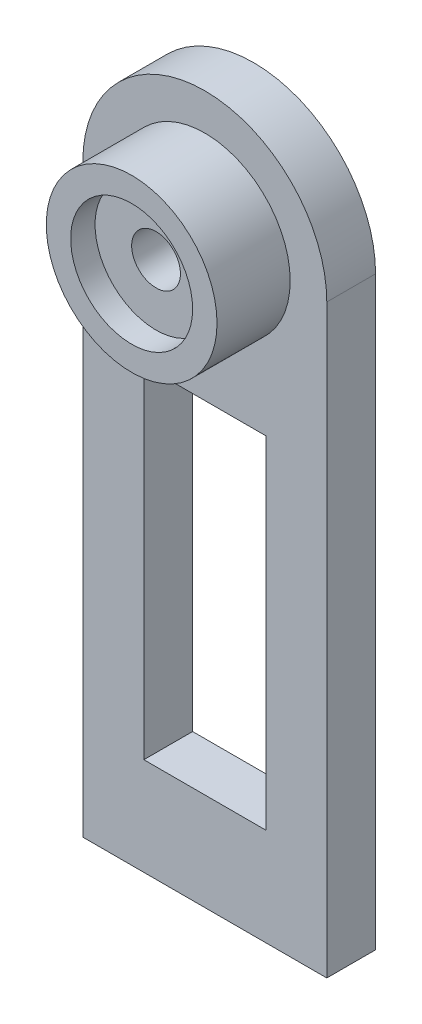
ISO-10303-21;
HEADER;
FILE_DESCRIPTION(('STEP AP214'),'2;1');
FILE_NAME('part.step','',(''),(''),'','','');
FILE_SCHEMA(('AUTOMOTIVE_DESIGN { 1 0 10303 214 1 1 1 1 }'));
ENDSEC;
DATA;
#1=APPLICATION_CONTEXT('core data for automotive mechanical design processes');
#2=APPLICATION_PROTOCOL_DEFINITION('international standard','automotive_design',2000,#1);
#3=PRODUCT_CONTEXT('',#1,'mechanical');
#4=PRODUCT('Part','Part','',(#3));
#5=PRODUCT_RELATED_PRODUCT_CATEGORY('part','',(#4));
#6=PRODUCT_DEFINITION_FORMATION('','',#4);
#7=PRODUCT_DEFINITION_CONTEXT('part definition',#1,'design');
#8=PRODUCT_DEFINITION('design','',#6,#7);
#9=PRODUCT_DEFINITION_SHAPE('','',#8);
#10=(LENGTH_UNIT() NAMED_UNIT(*) SI_UNIT(.MILLI.,.METRE.));
#11=(NAMED_UNIT(*) PLANE_ANGLE_UNIT() SI_UNIT($,.RADIAN.));
#12=(NAMED_UNIT(*) SI_UNIT($,.STERADIAN.) SOLID_ANGLE_UNIT());
#13=UNCERTAINTY_MEASURE_WITH_UNIT(LENGTH_MEASURE(1.E-05),#10,'distance_accuracy_value','');
#14=(GEOMETRIC_REPRESENTATION_CONTEXT(3) GLOBAL_UNCERTAINTY_ASSIGNED_CONTEXT((#13)) GLOBAL_UNIT_ASSIGNED_CONTEXT((#10,
#11,#12)) REPRESENTATION_CONTEXT('',''));
#15=CARTESIAN_POINT('',(0.,0.,0.));
#16=DIRECTION('',(0.,0.,1.));
#17=DIRECTION('',(1.,0.,0.));
#18=AXIS2_PLACEMENT_3D('',#15,#16,#17);
#19=CARTESIAN_POINT('',(50.,240.,0.));
#20=DIRECTION('',(0.,0.,1.));
#21=DIRECTION('',(1.,0.,0.));
#22=AXIS2_PLACEMENT_3D('',#19,#20,#21);
#23=PLANE('',#22);
#24=DIRECTION('',(0.,-1.,0.));
#25=VECTOR('',#24,1.);
#26=CARTESIAN_POINT('',(25.,40.,0.));
#27=LINE('',#26,#25);
#28=CARTESIAN_POINT('',(25.,180.,0.));
#29=VERTEX_POINT('',#28);
#30=CARTESIAN_POINT('',(25.,40.,0.));
#31=VERTEX_POINT('',#30);
#32=EDGE_CURVE('E52',#29,#31,#27,.T.);
#33=ORIENTED_EDGE('',*,*,#32,.F.);
#34=DIRECTION('',(-1.,0.,0.));
#35=VECTOR('',#34,1.);
#36=CARTESIAN_POINT('',(25.,180.,0.));
#37=LINE('',#36,#35);
#38=CARTESIAN_POINT('',(75.,180.,0.));
#39=VERTEX_POINT('',#38);
#40=EDGE_CURVE('E118',#39,#29,#37,.T.);
#41=ORIENTED_EDGE('',*,*,#40,.F.);
#42=DIRECTION('',(0.,1.,0.));
#43=VECTOR('',#42,1.);
#44=CARTESIAN_POINT('',(75.,40.,0.));
#45=LINE('',#44,#43);
#46=CARTESIAN_POINT('',(75.,40.,0.));
#47=VERTEX_POINT('',#46);
#48=EDGE_CURVE('E103',#47,#39,#45,.T.);
#49=ORIENTED_EDGE('',*,*,#48,.F.);
#50=DIRECTION('',(1.,0.,0.));
#51=VECTOR('',#50,1.);
#52=CARTESIAN_POINT('',(25.,40.,0.));
#53=LINE('',#52,#51);
#54=EDGE_CURVE('E112',#31,#47,#53,.T.);
#55=ORIENTED_EDGE('',*,*,#54,.F.);
#56=EDGE_LOOP('',(#33,#41,#49,#55));
#57=FACE_BOUND('',#56,.T.);
#58=DIRECTION('',(0.,-1.,0.));
#59=VECTOR('',#58,1.);
#60=CARTESIAN_POINT('',(0.,240.,0.));
#61=LINE('',#60,#59);
#62=CARTESIAN_POINT('',(0.,240.,0.));
#63=VERTEX_POINT('',#62);
#64=CARTESIAN_POINT('',(0.,0.,0.));
#65=VERTEX_POINT('',#64);
#66=EDGE_CURVE('E154',#63,#65,#61,.T.);
#67=ORIENTED_EDGE('',*,*,#66,.T.);
#68=DIRECTION('',(1.,0.,0.));
#69=VECTOR('',#68,1.);
#70=CARTESIAN_POINT('',(0.,0.,0.));
#71=LINE('',#70,#69);
#72=CARTESIAN_POINT('',(100.,0.,0.));
#73=VERTEX_POINT('',#72);
#74=EDGE_CURVE('E157',#65,#73,#71,.T.);
#75=ORIENTED_EDGE('',*,*,#74,.T.);
#76=DIRECTION('',(0.,1.,0.));
#77=VECTOR('',#76,1.);
#78=CARTESIAN_POINT('',(100.,0.,0.));
#79=LINE('',#78,#77);
#80=CARTESIAN_POINT('',(100.,240.,0.));
#81=VERTEX_POINT('',#80);
#82=EDGE_CURVE('E160',#73,#81,#79,.T.);
#83=ORIENTED_EDGE('',*,*,#82,.T.);
#84=CARTESIAN_POINT('',(50.,240.,0.));
#85=DIRECTION('',(0.,0.,1.));
#86=DIRECTION('',(1.,0.,0.));
#87=AXIS2_PLACEMENT_3D('',#84,#85,#86);
#88=CIRCLE('',#87,50.);
#89=EDGE_CURVE('E163',#81,#63,#88,.T.);
#90=ORIENTED_EDGE('',*,*,#89,.T.);
#91=EDGE_LOOP('',(#67,#75,#83,#90));
#92=FACE_BOUND('',#91,.T.);
#93=CARTESIAN_POINT('',(50.,240.,0.));
#94=DIRECTION('',(0.,0.,1.));
#95=DIRECTION('',(1.,0.,0.));
#96=AXIS2_PLACEMENT_3D('',#93,#94,#95);
#97=CIRCLE('',#96,35.);
#98=CARTESIAN_POINT('',(85.,240.,0.));
#99=VERTEX_POINT('',#98);
#100=EDGE_CURVE('E148',#99,#99,#97,.T.);
#101=ORIENTED_EDGE('',*,*,#100,.F.);
#102=EDGE_LOOP('',(#101));
#103=FACE_BOUND('',#102,.T.);
#104=ADVANCED_FACE('F35',(#57,#92,#103),#23,.T.);
#105=CARTESIAN_POINT('',(0.,240.,-20.));
#106=DIRECTION('',(-1.,0.,0.));
#107=DIRECTION('',(0.,0.,1.));
#108=AXIS2_PLACEMENT_3D('',#105,#106,#107);
#109=PLANE('',#108);
#110=ORIENTED_EDGE('',*,*,#66,.F.);
#111=DIRECTION('',(0.,0.,1.));
#112=VECTOR('',#111,1.);
#113=CARTESIAN_POINT('',(0.,240.,-20.));
#114=LINE('',#113,#112);
#115=CARTESIAN_POINT('',(0.,240.,-20.));
#116=VERTEX_POINT('',#115);
#117=EDGE_CURVE('E11',#116,#63,#114,.T.);
#118=ORIENTED_EDGE('',*,*,#117,.F.);
#119=DIRECTION('',(0.,-1.,0.));
#120=VECTOR('',#119,1.);
#121=CARTESIAN_POINT('',(0.,240.,-20.));
#122=LINE('',#121,#120);
#123=CARTESIAN_POINT('',(0.,0.,-20.));
#124=VERTEX_POINT('',#123);
#125=EDGE_CURVE('E166',#116,#124,#122,.T.);
#126=ORIENTED_EDGE('',*,*,#125,.T.);
#127=DIRECTION('',(0.,0.,1.));
#128=VECTOR('',#127,1.);
#129=CARTESIAN_POINT('',(0.,0.,-20.));
#130=LINE('',#129,#128);
#131=EDGE_CURVE('E39',#124,#65,#130,.T.);
#132=ORIENTED_EDGE('',*,*,#131,.T.);
#133=EDGE_LOOP('',(#110,#118,#126,#132));
#134=FACE_BOUND('',#133,.T.);
#135=ADVANCED_FACE('F37',(#134),#109,.T.);
#136=CARTESIAN_POINT('',(50.,240.,-20.));
#137=DIRECTION('',(0.,0.,1.));
#138=DIRECTION('',(1.,0.,0.));
#139=AXIS2_PLACEMENT_3D('',#136,#137,#138);
#140=CYLINDRICAL_SURFACE('',#139,50.);
#141=ORIENTED_EDGE('',*,*,#89,.F.);
#142=DIRECTION('',(0.,0.,1.));
#143=VECTOR('',#142,1.);
#144=CARTESIAN_POINT('',(100.,240.,-20.));
#145=LINE('',#144,#143);
#146=CARTESIAN_POINT('',(100.,240.,-20.));
#147=VERTEX_POINT('',#146);
#148=EDGE_CURVE('E44',#147,#81,#145,.T.);
#149=ORIENTED_EDGE('',*,*,#148,.F.);
#150=CARTESIAN_POINT('',(50.,240.,-20.));
#151=DIRECTION('',(0.,0.,1.));
#152=DIRECTION('',(1.,0.,0.));
#153=AXIS2_PLACEMENT_3D('',#150,#151,#152);
#154=CIRCLE('',#153,50.);
#155=EDGE_CURVE('E175',#147,#116,#154,.T.);
#156=ORIENTED_EDGE('',*,*,#155,.T.);
#157=ORIENTED_EDGE('',*,*,#117,.T.);
#158=EDGE_LOOP('',(#141,#149,#156,#157));
#159=FACE_BOUND('',#158,.T.);
#160=ADVANCED_FACE('F190',(#159),#140,.T.);
#161=CARTESIAN_POINT('',(100.,0.,-20.));
#162=DIRECTION('',(1.,0.,0.));
#163=DIRECTION('',(0.,0.,-1.));
#164=AXIS2_PLACEMENT_3D('',#161,#162,#163);
#165=PLANE('',#164);
#166=ORIENTED_EDGE('',*,*,#82,.F.);
#167=DIRECTION('',(0.,0.,1.));
#168=VECTOR('',#167,1.);
#169=CARTESIAN_POINT('',(100.,0.,-20.));
#170=LINE('',#169,#168);
#171=CARTESIAN_POINT('',(100.,0.,-20.));
#172=VERTEX_POINT('',#171);
#173=EDGE_CURVE('E178',#172,#73,#170,.T.);
#174=ORIENTED_EDGE('',*,*,#173,.F.);
#175=DIRECTION('',(0.,1.,0.));
#176=VECTOR('',#175,1.);
#177=CARTESIAN_POINT('',(100.,0.,-20.));
#178=LINE('',#177,#176);
#179=EDGE_CURVE('E172',#172,#147,#178,.T.);
#180=ORIENTED_EDGE('',*,*,#179,.T.);
#181=ORIENTED_EDGE('',*,*,#148,.T.);
#182=EDGE_LOOP('',(#166,#174,#180,#181));
#183=FACE_BOUND('',#182,.T.);
#184=ADVANCED_FACE('F196',(#183),#165,.T.);
#185=CARTESIAN_POINT('',(0.,0.,-20.));
#186=DIRECTION('',(0.,-1.,0.));
#187=DIRECTION('',(0.,0.,-1.));
#188=AXIS2_PLACEMENT_3D('',#185,#186,#187);
#189=PLANE('',#188);
#190=ORIENTED_EDGE('',*,*,#74,.F.);
#191=ORIENTED_EDGE('',*,*,#131,.F.);
#192=DIRECTION('',(1.,0.,0.));
#193=VECTOR('',#192,1.);
#194=CARTESIAN_POINT('',(0.,0.,-20.));
#195=LINE('',#194,#193);
#196=EDGE_CURVE('E169',#124,#172,#195,.T.);
#197=ORIENTED_EDGE('',*,*,#196,.T.);
#198=ORIENTED_EDGE('',*,*,#173,.T.);
#199=EDGE_LOOP('',(#190,#191,#197,#198));
#200=FACE_BOUND('',#199,.T.);
#201=ADVANCED_FACE('F186',(#200),#189,.T.);
#202=CARTESIAN_POINT('',(50.,240.,-20.));
#203=DIRECTION('',(0.,0.,1.));
#204=DIRECTION('',(1.,0.,0.));
#205=AXIS2_PLACEMENT_3D('',#202,#203,#204);
#206=PLANE('',#205);
#207=DIRECTION('',(-1.,0.,0.));
#208=VECTOR('',#207,1.);
#209=CARTESIAN_POINT('',(25.,180.,-20.));
#210=LINE('',#209,#208);
#211=CARTESIAN_POINT('',(75.,180.,-20.));
#212=VERTEX_POINT('',#211);
#213=CARTESIAN_POINT('',(25.,180.,-20.));
#214=VERTEX_POINT('',#213);
#215=EDGE_CURVE('E129',#212,#214,#210,.T.);
#216=ORIENTED_EDGE('',*,*,#215,.T.);
#217=DIRECTION('',(0.,-1.,0.));
#218=VECTOR('',#217,1.);
#219=CARTESIAN_POINT('',(25.,40.,-20.));
#220=LINE('',#219,#218);
#221=CARTESIAN_POINT('',(25.,40.,-20.));
#222=VERTEX_POINT('',#221);
#223=EDGE_CURVE('E120',#214,#222,#220,.T.);
#224=ORIENTED_EDGE('',*,*,#223,.T.);
#225=DIRECTION('',(1.,0.,0.));
#226=VECTOR('',#225,1.);
#227=CARTESIAN_POINT('',(25.,40.,-20.));
#228=LINE('',#227,#226);
#229=CARTESIAN_POINT('',(75.,40.,-20.));
#230=VERTEX_POINT('',#229);
#231=EDGE_CURVE('E126',#222,#230,#228,.T.);
#232=ORIENTED_EDGE('',*,*,#231,.T.);
#233=DIRECTION('',(0.,1.,0.));
#234=VECTOR('',#233,1.);
#235=CARTESIAN_POINT('',(75.,40.,-20.));
#236=LINE('',#235,#234);
#237=EDGE_CURVE('E60',#230,#212,#236,.T.);
#238=ORIENTED_EDGE('',*,*,#237,.T.);
#239=EDGE_LOOP('',(#216,#224,#232,#238));
#240=FACE_BOUND('',#239,.T.);
#241=CARTESIAN_POINT('',(50.,240.,-20.));
#242=DIRECTION('',(0.,0.,1.));
#243=DIRECTION('',(1.,0.,0.));
#244=AXIS2_PLACEMENT_3D('',#241,#242,#243);
#245=CIRCLE('',#244,9.99999999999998);
#246=CARTESIAN_POINT('',(60.,240.,-20.));
#247=VERTEX_POINT('',#246);
#248=EDGE_CURVE('E134',#247,#247,#245,.T.);
#249=ORIENTED_EDGE('',*,*,#248,.T.);
#250=EDGE_LOOP('',(#249));
#251=FACE_BOUND('',#250,.T.);
#252=ORIENTED_EDGE('',*,*,#125,.F.);
#253=ORIENTED_EDGE('',*,*,#155,.F.);
#254=ORIENTED_EDGE('',*,*,#179,.F.);
#255=ORIENTED_EDGE('',*,*,#196,.F.);
#256=EDGE_LOOP('',(#252,#253,#254,#255));
#257=FACE_BOUND('',#256,.T.);
#258=ADVANCED_FACE('F193',(#240,#251,#257),#206,.F.);
#259=CARTESIAN_POINT('',(50.,240.,30.));
#260=DIRECTION('',(0.,0.,-1.));
#261=DIRECTION('',(-1.,0.,0.));
#262=AXIS2_PLACEMENT_3D('',#259,#260,#261);
#263=CYLINDRICAL_SURFACE('',#262,35.);
#264=CARTESIAN_POINT('',(50.,240.,30.));
#265=DIRECTION('',(0.,0.,1.));
#266=DIRECTION('',(1.,0.,0.));
#267=AXIS2_PLACEMENT_3D('',#264,#265,#266);
#268=CIRCLE('',#267,35.);
#269=CARTESIAN_POINT('',(85.,240.,30.));
#270=VERTEX_POINT('',#269);
#271=EDGE_CURVE('E151',#270,#270,#268,.T.);
#272=ORIENTED_EDGE('',*,*,#271,.F.);
#273=EDGE_LOOP('',(#272));
#274=FACE_BOUND('',#273,.T.);
#275=ORIENTED_EDGE('',*,*,#100,.T.);
#276=EDGE_LOOP('',(#275));
#277=FACE_BOUND('',#276,.T.);
#278=ADVANCED_FACE('F211',(#274,#277),#263,.T.);
#279=CARTESIAN_POINT('',(50.,240.,30.));
#280=DIRECTION('',(0.,0.,1.));
#281=DIRECTION('',(1.,0.,0.));
#282=AXIS2_PLACEMENT_3D('',#279,#280,#281);
#283=PLANE('',#282);
#284=CARTESIAN_POINT('',(50.,240.,30.));
#285=DIRECTION('',(0.,0.,1.));
#286=DIRECTION('',(1.,0.,0.));
#287=AXIS2_PLACEMENT_3D('',#284,#285,#286);
#288=CIRCLE('',#287,25.);
#289=CARTESIAN_POINT('',(75.,240.,30.));
#290=VERTEX_POINT('',#289);
#291=EDGE_CURVE('E145',#290,#290,#288,.T.);
#292=ORIENTED_EDGE('',*,*,#291,.F.);
#293=EDGE_LOOP('',(#292));
#294=FACE_BOUND('',#293,.T.);
#295=ORIENTED_EDGE('',*,*,#271,.T.);
#296=EDGE_LOOP('',(#295));
#297=FACE_BOUND('',#296,.T.);
#298=ADVANCED_FACE('F218',(#294,#297),#283,.T.);
#299=CARTESIAN_POINT('',(50.,240.,30.));
#300=DIRECTION('',(0.,0.,1.));
#301=DIRECTION('',(1.,0.,0.));
#302=AXIS2_PLACEMENT_3D('',#299,#300,#301);
#303=CYLINDRICAL_SURFACE('',#302,25.);
#304=CARTESIAN_POINT('',(50.,240.,20.));
#305=DIRECTION('',(0.,0.,1.));
#306=DIRECTION('',(1.,0.,0.));
#307=AXIS2_PLACEMENT_3D('',#304,#305,#306);
#308=CIRCLE('',#307,25.);
#309=CARTESIAN_POINT('',(75.,240.,20.));
#310=VERTEX_POINT('',#309);
#311=EDGE_CURVE('E142',#310,#310,#308,.T.);
#312=ORIENTED_EDGE('',*,*,#311,.F.);
#313=EDGE_LOOP('',(#312));
#314=FACE_BOUND('',#313,.T.);
#315=ORIENTED_EDGE('',*,*,#291,.T.);
#316=EDGE_LOOP('',(#315));
#317=FACE_BOUND('',#316,.T.);
#318=ADVANCED_FACE('F234',(#314,#317),#303,.F.);
#319=CARTESIAN_POINT('',(60.,240.,20.));
#320=DIRECTION('',(0.,0.,-1.));
#321=DIRECTION('',(-1.,0.,0.));
#322=AXIS2_PLACEMENT_3D('',#319,#320,#321);
#323=PLANE('',#322);
#324=CARTESIAN_POINT('',(50.,240.,20.));
#325=DIRECTION('',(0.,0.,1.));
#326=DIRECTION('',(1.,0.,0.));
#327=AXIS2_PLACEMENT_3D('',#324,#325,#326);
#328=CIRCLE('',#327,9.99999999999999);
#329=CARTESIAN_POINT('',(60.,240.,20.));
#330=VERTEX_POINT('',#329);
#331=EDGE_CURVE('E139',#330,#330,#328,.T.);
#332=ORIENTED_EDGE('',*,*,#331,.F.);
#333=EDGE_LOOP('',(#332));
#334=FACE_BOUND('',#333,.T.);
#335=ORIENTED_EDGE('',*,*,#311,.T.);
#336=EDGE_LOOP('',(#335));
#337=FACE_BOUND('',#336,.T.);
#338=ADVANCED_FACE('F228',(#334,#337),#323,.F.);
#339=CARTESIAN_POINT('',(50.,240.,30.));
#340=DIRECTION('',(0.,0.,1.));
#341=DIRECTION('',(1.,0.,0.));
#342=AXIS2_PLACEMENT_3D('',#339,#340,#341);
#343=CYLINDRICAL_SURFACE('',#342,9.99999999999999);
#344=ORIENTED_EDGE('',*,*,#248,.F.);
#345=EDGE_LOOP('',(#344));
#346=FACE_BOUND('',#345,.T.);
#347=ORIENTED_EDGE('',*,*,#331,.T.);
#348=EDGE_LOOP('',(#347));
#349=FACE_BOUND('',#348,.T.);
#350=ADVANCED_FACE('F224',(#346,#349),#343,.F.);
#351=CARTESIAN_POINT('',(25.,40.,-20.));
#352=DIRECTION('',(-1.,0.,0.));
#353=DIRECTION('',(0.,0.,1.));
#354=AXIS2_PLACEMENT_3D('',#351,#352,#353);
#355=PLANE('',#354);
#356=ORIENTED_EDGE('',*,*,#32,.T.);
#357=DIRECTION('',(0.,0.,1.));
#358=VECTOR('',#357,1.);
#359=CARTESIAN_POINT('',(25.,40.,-20.));
#360=LINE('',#359,#358);
#361=EDGE_CURVE('E109',#222,#31,#360,.T.);
#362=ORIENTED_EDGE('',*,*,#361,.F.);
#363=ORIENTED_EDGE('',*,*,#223,.F.);
#364=DIRECTION('',(0.,0.,1.));
#365=VECTOR('',#364,1.);
#366=CARTESIAN_POINT('',(25.,180.,-20.));
#367=LINE('',#366,#365);
#368=EDGE_CURVE('E132',#214,#29,#367,.T.);
#369=ORIENTED_EDGE('',*,*,#368,.T.);
#370=EDGE_LOOP('',(#356,#362,#363,#369));
#371=FACE_BOUND('',#370,.T.);
#372=ADVANCED_FACE('F227',(#371),#355,.F.);
#373=CARTESIAN_POINT('',(25.,180.,-20.));
#374=DIRECTION('',(0.,1.,0.));
#375=DIRECTION('',(0.,0.,1.));
#376=AXIS2_PLACEMENT_3D('',#373,#374,#375);
#377=PLANE('',#376);
#378=ORIENTED_EDGE('',*,*,#40,.T.);
#379=ORIENTED_EDGE('',*,*,#368,.F.);
#380=ORIENTED_EDGE('',*,*,#215,.F.);
#381=DIRECTION('',(0.,0.,1.));
#382=VECTOR('',#381,1.);
#383=CARTESIAN_POINT('',(75.,180.,-20.));
#384=LINE('',#383,#382);
#385=EDGE_CURVE('E108',#212,#39,#384,.T.);
#386=ORIENTED_EDGE('',*,*,#385,.T.);
#387=EDGE_LOOP('',(#378,#379,#380,#386));
#388=FACE_BOUND('',#387,.T.);
#389=ADVANCED_FACE('F253',(#388),#377,.F.);
#390=CARTESIAN_POINT('',(75.,40.,-20.));
#391=DIRECTION('',(1.,0.,0.));
#392=DIRECTION('',(0.,0.,-1.));
#393=AXIS2_PLACEMENT_3D('',#390,#391,#392);
#394=PLANE('',#393);
#395=ORIENTED_EDGE('',*,*,#48,.T.);
#396=ORIENTED_EDGE('',*,*,#385,.F.);
#397=ORIENTED_EDGE('',*,*,#237,.F.);
#398=DIRECTION('',(0.,0.,1.));
#399=VECTOR('',#398,1.);
#400=CARTESIAN_POINT('',(75.,40.,-20.));
#401=LINE('',#400,#399);
#402=EDGE_CURVE('E99',#230,#47,#401,.T.);
#403=ORIENTED_EDGE('',*,*,#402,.T.);
#404=EDGE_LOOP('',(#395,#396,#397,#403));
#405=FACE_BOUND('',#404,.T.);
#406=ADVANCED_FACE('F101',(#405),#394,.F.);
#407=CARTESIAN_POINT('',(25.,40.,-20.));
#408=DIRECTION('',(0.,-1.,0.));
#409=DIRECTION('',(0.,0.,-1.));
#410=AXIS2_PLACEMENT_3D('',#407,#408,#409);
#411=PLANE('',#410);
#412=ORIENTED_EDGE('',*,*,#54,.T.);
#413=ORIENTED_EDGE('',*,*,#402,.F.);
#414=ORIENTED_EDGE('',*,*,#231,.F.);
#415=ORIENTED_EDGE('',*,*,#361,.T.);
#416=EDGE_LOOP('',(#412,#413,#414,#415));
#417=FACE_BOUND('',#416,.T.);
#418=ADVANCED_FACE('F113',(#417),#411,.F.);
#419=CLOSED_SHELL('',(#104,#135,#160,#184,#201,#258,#278,#298,#318,#338,#350,#372,#389,#406,#418));
#420=MANIFOLD_SOLID_BREP('B2',#419);
#421=ADVANCED_BREP_SHAPE_REPRESENTATION('',(#18,#420),#14);
#422=SHAPE_DEFINITION_REPRESENTATION(#9,#421);
ENDSEC;
END-ISO-10303-21;
